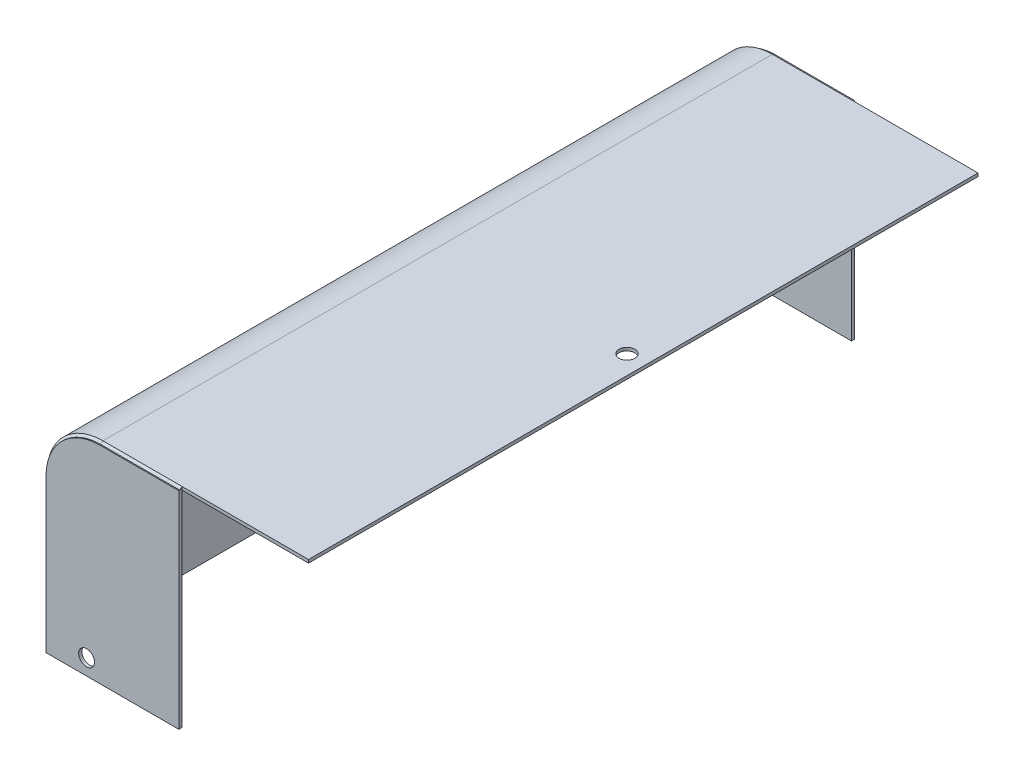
ISO-10303-21;
HEADER;
FILE_DESCRIPTION(('STEP AP214'),'2;1');
FILE_NAME('part.step','',(''),(''),'','','');
FILE_SCHEMA(('AUTOMOTIVE_DESIGN { 1 0 10303 214 1 1 1 1 }'));
ENDSEC;
DATA;
#1=APPLICATION_CONTEXT('core data for automotive mechanical design processes');
#2=APPLICATION_PROTOCOL_DEFINITION('international standard','automotive_design',2000,#1);
#3=PRODUCT_CONTEXT('',#1,'mechanical');
#4=PRODUCT('Part','Part','',(#3));
#5=PRODUCT_RELATED_PRODUCT_CATEGORY('part','',(#4));
#6=PRODUCT_DEFINITION_FORMATION('','',#4);
#7=PRODUCT_DEFINITION_CONTEXT('part definition',#1,'design');
#8=PRODUCT_DEFINITION('design','',#6,#7);
#9=PRODUCT_DEFINITION_SHAPE('','',#8);
#10=(LENGTH_UNIT() NAMED_UNIT(*) SI_UNIT(.MILLI.,.METRE.));
#11=(NAMED_UNIT(*) PLANE_ANGLE_UNIT() SI_UNIT($,.RADIAN.));
#12=(NAMED_UNIT(*) SI_UNIT($,.STERADIAN.) SOLID_ANGLE_UNIT());
#13=UNCERTAINTY_MEASURE_WITH_UNIT(LENGTH_MEASURE(1.E-05),#10,'distance_accuracy_value','');
#14=(GEOMETRIC_REPRESENTATION_CONTEXT(3) GLOBAL_UNCERTAINTY_ASSIGNED_CONTEXT((#13)) GLOBAL_UNIT_ASSIGNED_CONTEXT((#10,
#11,#12)) REPRESENTATION_CONTEXT('',''));
#15=CARTESIAN_POINT('',(0.,0.,0.));
#16=DIRECTION('',(0.,0.,1.));
#17=DIRECTION('',(1.,0.,0.));
#18=AXIS2_PLACEMENT_3D('',#15,#16,#17);
#19=CARTESIAN_POINT('',(-32.3472856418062,-130.353881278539,635.));
#20=DIRECTION('',(0.,1.,0.));
#21=DIRECTION('',(0.,0.,1.));
#22=AXIS2_PLACEMENT_3D('',#19,#20,#21);
#23=PLANE('',#22);
#24=DIRECTION('',(1.,0.,0.));
#25=VECTOR('',#24,1.);
#26=CARTESIAN_POINT('',(20.6527143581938,-130.353881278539,635.));
#27=LINE('',#26,#25);
#28=CARTESIAN_POINT('',(-32.3472856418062,-130.353881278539,635.));
#29=VERTEX_POINT('',#28);
#30=CARTESIAN_POINT('',(-30.3472856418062,-130.353881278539,635.));
#31=VERTEX_POINT('',#30);
#32=EDGE_CURVE('E125',#29,#31,#27,.T.);
#33=ORIENTED_EDGE('',*,*,#32,.T.);
#34=DIRECTION('',(0.,0.,-1.));
#35=VECTOR('',#34,1.);
#36=CARTESIAN_POINT('',(-30.3472856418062,-130.353881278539,635.));
#37=LINE('',#36,#35);
#38=CARTESIAN_POINT('',(-30.3472856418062,-130.353881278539,637.));
#39=VERTEX_POINT('',#38);
#40=EDGE_CURVE('E64',#39,#31,#37,.T.);
#41=ORIENTED_EDGE('',*,*,#40,.F.);
#42=DIRECTION('',(0.707106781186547,0.,0.707106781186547));
#43=VECTOR('',#42,1.);
#44=CARTESIAN_POINT('',(-32.3472856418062,-130.353881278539,635.));
#45=LINE('',#44,#43);
#46=EDGE_CURVE('E12',#39,#29,#45,.F.);
#47=ORIENTED_EDGE('',*,*,#46,.T.);
#48=EDGE_LOOP('',(#33,#41,#47));
#49=FACE_BOUND('',#48,.T.);
#50=ADVANCED_FACE('F42',(#49),#23,.F.);
#51=CARTESIAN_POINT('',(95.6527143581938,-130.353881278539,638.));
#52=DIRECTION('',(-1.,0.,0.));
#53=DIRECTION('',(0.,0.,1.));
#54=AXIS2_PLACEMENT_3D('',#51,#52,#53);
#55=PLANE('',#54);
#56=DIRECTION('',(0.,0.,-1.));
#57=VECTOR('',#56,1.);
#58=CARTESIAN_POINT('',(95.6527143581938,65.6461187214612,638.));
#59=LINE('',#58,#57);
#60=CARTESIAN_POINT('',(95.6527143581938,65.6461187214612,637.));
#61=VERTEX_POINT('',#60);
#62=CARTESIAN_POINT('',(95.6527143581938,65.6461187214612,635.));
#63=VERTEX_POINT('',#62);
#64=EDGE_CURVE('E57',#61,#63,#59,.T.);
#65=ORIENTED_EDGE('',*,*,#64,.T.);
#66=DIRECTION('',(0.,-1.,0.));
#67=VECTOR('',#66,1.);
#68=CARTESIAN_POINT('',(95.6527143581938,-130.353881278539,635.));
#69=LINE('',#68,#67);
#70=CARTESIAN_POINT('',(95.6527143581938,67.6461187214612,635.));
#71=VERTEX_POINT('',#70);
#72=EDGE_CURVE('E130',#71,#63,#69,.T.);
#73=ORIENTED_EDGE('',*,*,#72,.F.);
#74=DIRECTION('',(0.,0.707106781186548,-0.707106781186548));
#75=VECTOR('',#74,1.);
#76=CARTESIAN_POINT('',(95.6527143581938,-32.8538812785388,735.5));
#77=LINE('',#76,#75);
#78=EDGE_CURVE('E50',#71,#61,#77,.F.);
#79=ORIENTED_EDGE('',*,*,#78,.T.);
#80=EDGE_LOOP('',(#65,#73,#79));
#81=FACE_BOUND('',#80,.T.);
#82=ADVANCED_FACE('F44',(#81),#55,.F.);
#83=CARTESIAN_POINT('',(-30.3472856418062,14.6461187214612,637.));
#84=DIRECTION('',(-0.707106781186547,0.,0.707106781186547));
#85=DIRECTION('',(0.707106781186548,0.,0.707106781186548));
#86=AXIS2_PLACEMENT_3D('',#83,#84,#85);
#87=PLANE('',#86);
#88=ORIENTED_EDGE('',*,*,#46,.F.);
#89=DIRECTION('',(0.,-1.,0.));
#90=VECTOR('',#89,1.);
#91=CARTESIAN_POINT('',(-30.3472856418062,-130.353881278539,637.));
#92=LINE('',#91,#90);
#93=CARTESIAN_POINT('',(-30.3472856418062,14.6461187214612,637.));
#94=VERTEX_POINT('',#93);
#95=EDGE_CURVE('E144',#94,#39,#92,.T.);
#96=ORIENTED_EDGE('',*,*,#95,.F.);
#97=DIRECTION('',(0.707106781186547,0.,0.707106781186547));
#98=VECTOR('',#97,1.);
#99=CARTESIAN_POINT('',(-32.3472856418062,14.6461187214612,635.));
#100=LINE('',#99,#98);
#101=CARTESIAN_POINT('',(-32.3472856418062,14.6461187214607,635.));
#102=VERTEX_POINT('',#101);
#103=EDGE_CURVE('E135',#102,#94,#100,.T.);
#104=ORIENTED_EDGE('',*,*,#103,.F.);
#105=DIRECTION('',(0.,-1.,0.));
#106=VECTOR('',#105,1.);
#107=CARTESIAN_POINT('',(-32.3472856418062,14.6461187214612,635.));
#108=LINE('',#107,#106);
#109=EDGE_CURVE('E116',#102,#29,#108,.T.);
#110=ORIENTED_EDGE('',*,*,#109,.T.);
#111=EDGE_LOOP('',(#88,#96,#104,#110));
#112=FACE_BOUND('',#111,.T.);
#113=ADVANCED_FACE('F166',(#112),#87,.T.);
#114=CARTESIAN_POINT('',(20.6527143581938,14.6461187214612,637.));
#115=DIRECTION('',(0.,0.,-1.));
#116=DIRECTION('',(-1.,0.,0.));
#117=AXIS2_PLACEMENT_3D('',#114,#115,#116);
#118=CONICAL_SURFACE('',#117,51.,0.785398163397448);
#119=ORIENTED_EDGE('',*,*,#103,.T.);
#120=CARTESIAN_POINT('',(20.6527143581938,14.6461187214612,637.));
#121=DIRECTION('',(0.,0.,-1.));
#122=DIRECTION('',(-1.,0.,0.));
#123=AXIS2_PLACEMENT_3D('',#120,#121,#122);
#124=CIRCLE('',#123,51.);
#125=CARTESIAN_POINT('',(20.6527143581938,65.6461187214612,637.));
#126=VERTEX_POINT('',#125);
#127=EDGE_CURVE('E104',#126,#94,#124,.F.);
#128=ORIENTED_EDGE('',*,*,#127,.F.);
#129=DIRECTION('',(0.,-0.707106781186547,0.707106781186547));
#130=VECTOR('',#129,1.);
#131=CARTESIAN_POINT('',(20.6527143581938,67.6461187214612,635.));
#132=LINE('',#131,#130);
#133=CARTESIAN_POINT('',(20.6527143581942,67.6461187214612,635.));
#134=VERTEX_POINT('',#133);
#135=EDGE_CURVE('E132',#134,#126,#132,.T.);
#136=ORIENTED_EDGE('',*,*,#135,.F.);
#137=CARTESIAN_POINT('',(20.6527143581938,14.6461187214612,635.));
#138=DIRECTION('',(0.,0.,-1.));
#139=DIRECTION('',(-1.,0.,0.));
#140=AXIS2_PLACEMENT_3D('',#137,#138,#139);
#141=CIRCLE('',#140,53.);
#142=EDGE_CURVE('E120',#134,#102,#141,.F.);
#143=ORIENTED_EDGE('',*,*,#142,.T.);
#144=EDGE_LOOP('',(#119,#128,#136,#143));
#145=FACE_BOUND('',#144,.T.);
#146=ADVANCED_FACE('F170',(#145),#118,.T.);
#147=CARTESIAN_POINT('',(95.6527143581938,65.6461187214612,637.));
#148=DIRECTION('',(0.,0.707106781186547,0.707106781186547));
#149=DIRECTION('',(0.,-0.707106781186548,0.707106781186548));
#150=AXIS2_PLACEMENT_3D('',#147,#148,#149);
#151=PLANE('',#150);
#152=ORIENTED_EDGE('',*,*,#78,.F.);
#153=DIRECTION('',(-1.,0.,0.));
#154=VECTOR('',#153,1.);
#155=CARTESIAN_POINT('',(20.6527143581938,67.6461187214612,635.));
#156=LINE('',#155,#154);
#157=EDGE_CURVE('E138',#71,#134,#156,.T.);
#158=ORIENTED_EDGE('',*,*,#157,.T.);
#159=ORIENTED_EDGE('',*,*,#135,.T.);
#160=DIRECTION('',(-1.,0.,0.));
#161=VECTOR('',#160,1.);
#162=CARTESIAN_POINT('',(20.6527143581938,65.6461187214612,637.));
#163=LINE('',#162,#161);
#164=EDGE_CURVE('E141',#61,#126,#163,.T.);
#165=ORIENTED_EDGE('',*,*,#164,.F.);
#166=EDGE_LOOP('',(#152,#158,#159,#165));
#167=FACE_BOUND('',#166,.T.);
#168=ADVANCED_FACE('F150',(#167),#151,.T.);
#169=CARTESIAN_POINT('',(-30.3472856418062,14.6461187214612,638.));
#170=DIRECTION('',(1.,0.,0.));
#171=DIRECTION('',(0.,1.,0.));
#172=AXIS2_PLACEMENT_3D('',#169,#170,#171);
#173=PLANE('',#172);
#174=ORIENTED_EDGE('',*,*,#95,.T.);
#175=ORIENTED_EDGE('',*,*,#40,.T.);
#176=DIRECTION('',(0.,-1.,0.));
#177=VECTOR('',#176,1.);
#178=CARTESIAN_POINT('',(-30.3472856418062,14.6461187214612,635.));
#179=LINE('',#178,#177);
#180=CARTESIAN_POINT('',(-30.3472856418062,14.6461187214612,635.));
#181=VERTEX_POINT('',#180);
#182=EDGE_CURVE('E110',#181,#31,#179,.T.);
#183=ORIENTED_EDGE('',*,*,#182,.F.);
#184=DIRECTION('',(0.,0.,1.));
#185=VECTOR('',#184,1.);
#186=CARTESIAN_POINT('',(-30.3472856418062,14.6461187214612,638.));
#187=LINE('',#186,#185);
#188=EDGE_CURVE('E96',#94,#181,#187,.F.);
#189=ORIENTED_EDGE('',*,*,#188,.F.);
#190=EDGE_LOOP('',(#174,#175,#183,#189));
#191=FACE_BOUND('',#190,.T.);
#192=ADVANCED_FACE('F111',(#191),#173,.T.);
#193=CARTESIAN_POINT('',(20.6527143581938,14.6461187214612,635.));
#194=DIRECTION('',(0.,0.,-1.));
#195=DIRECTION('',(-1.,0.,0.));
#196=AXIS2_PLACEMENT_3D('',#193,#194,#195);
#197=PLANE('',#196);
#198=ORIENTED_EDGE('',*,*,#72,.T.);
#199=DIRECTION('',(-1.,0.,0.));
#200=VECTOR('',#199,1.);
#201=CARTESIAN_POINT('',(20.6527143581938,65.6461187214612,635.));
#202=LINE('',#201,#200);
#203=CARTESIAN_POINT('',(20.6527143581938,65.6461187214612,635.));
#204=VERTEX_POINT('',#203);
#205=EDGE_CURVE('E113',#63,#204,#202,.T.);
#206=ORIENTED_EDGE('',*,*,#205,.T.);
#207=CARTESIAN_POINT('',(20.6527143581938,14.6461187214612,635.));
#208=DIRECTION('',(0.,0.,-1.));
#209=DIRECTION('',(-1.,0.,0.));
#210=AXIS2_PLACEMENT_3D('',#207,#208,#209);
#211=CIRCLE('',#210,51.);
#212=EDGE_CURVE('E101',#204,#181,#211,.F.);
#213=ORIENTED_EDGE('',*,*,#212,.T.);
#214=ORIENTED_EDGE('',*,*,#182,.T.);
#215=ORIENTED_EDGE('',*,*,#32,.F.);
#216=ORIENTED_EDGE('',*,*,#109,.F.);
#217=ORIENTED_EDGE('',*,*,#142,.F.);
#218=ORIENTED_EDGE('',*,*,#157,.F.);
#219=EDGE_LOOP('',(#198,#206,#213,#214,#215,#216,#217,#218));
#220=FACE_BOUND('',#219,.T.);
#221=ADVANCED_FACE('F115',(#220),#197,.T.);
#222=CARTESIAN_POINT('',(95.6527143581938,65.6461187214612,638.));
#223=DIRECTION('',(0.,-1.,0.));
#224=DIRECTION('',(0.,0.,-1.));
#225=AXIS2_PLACEMENT_3D('',#222,#223,#224);
#226=PLANE('',#225);
#227=ORIENTED_EDGE('',*,*,#164,.T.);
#228=DIRECTION('',(0.,0.,-1.));
#229=VECTOR('',#228,1.);
#230=CARTESIAN_POINT('',(20.6527143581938,65.6461187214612,638.));
#231=LINE('',#230,#229);
#232=EDGE_CURVE('E107',#126,#204,#231,.T.);
#233=ORIENTED_EDGE('',*,*,#232,.T.);
#234=ORIENTED_EDGE('',*,*,#205,.F.);
#235=ORIENTED_EDGE('',*,*,#64,.F.);
#236=EDGE_LOOP('',(#227,#233,#234,#235));
#237=FACE_BOUND('',#236,.T.);
#238=ADVANCED_FACE('F152',(#237),#226,.T.);
#239=CARTESIAN_POINT('',(20.6527143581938,14.6461187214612,638.));
#240=DIRECTION('',(0.,0.,-1.));
#241=DIRECTION('',(-1.,0.,0.));
#242=AXIS2_PLACEMENT_3D('',#239,#240,#241);
#243=CYLINDRICAL_SURFACE('',#242,51.);
#244=ORIENTED_EDGE('',*,*,#127,.T.);
#245=ORIENTED_EDGE('',*,*,#188,.T.);
#246=ORIENTED_EDGE('',*,*,#212,.F.);
#247=ORIENTED_EDGE('',*,*,#232,.F.);
#248=EDGE_LOOP('',(#244,#245,#246,#247));
#249=FACE_BOUND('',#248,.T.);
#250=ADVANCED_FACE('F98',(#249),#243,.F.);
#251=CLOSED_SHELL('',(#50,#82,#113,#146,#168,#192,#221,#238,#250));
#252=MANIFOLD_SOLID_BREP('B2',#251);
#253=CARTESIAN_POINT('',(95.6527143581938,-130.353881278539,-3.));
#254=DIRECTION('',(-1.,0.,0.));
#255=DIRECTION('',(0.,0.,1.));
#256=AXIS2_PLACEMENT_3D('',#253,#254,#255);
#257=PLANE('',#256);
#258=DIRECTION('',(0.,0.,1.));
#259=VECTOR('',#258,1.);
#260=CARTESIAN_POINT('',(95.6527143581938,65.6461187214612,-3.));
#261=LINE('',#260,#259);
#262=CARTESIAN_POINT('',(95.6527143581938,65.6461187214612,-2.));
#263=VERTEX_POINT('',#262);
#264=CARTESIAN_POINT('',(95.6527143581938,65.6461187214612,0.));
#265=VERTEX_POINT('',#264);
#266=EDGE_CURVE('E294',#263,#265,#261,.T.);
#267=ORIENTED_EDGE('',*,*,#266,.F.);
#268=DIRECTION('',(0.,0.707106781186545,0.70710678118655));
#269=VECTOR('',#268,1.);
#270=CARTESIAN_POINT('',(95.6527143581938,-32.8538812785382,-100.5));
#271=LINE('',#270,#269);
#272=CARTESIAN_POINT('',(95.6527143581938,67.6461187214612,0.));
#273=VERTEX_POINT('',#272);
#274=EDGE_CURVE('E40',#263,#273,#271,.T.);
#275=ORIENTED_EDGE('',*,*,#274,.T.);
#276=DIRECTION('',(0.,-1.,0.));
#277=VECTOR('',#276,1.);
#278=CARTESIAN_POINT('',(95.6527143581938,-130.353881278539,0.));
#279=LINE('',#278,#277);
#280=EDGE_CURVE('E306',#273,#265,#279,.T.);
#281=ORIENTED_EDGE('',*,*,#280,.T.);
#282=EDGE_LOOP('',(#267,#275,#281));
#283=FACE_BOUND('',#282,.T.);
#284=ADVANCED_FACE('F242',(#283),#257,.F.);
#285=CARTESIAN_POINT('',(-32.3472856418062,-130.353881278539,635.));
#286=DIRECTION('',(0.,1.,0.));
#287=DIRECTION('',(0.,0.,1.));
#288=AXIS2_PLACEMENT_3D('',#285,#286,#287);
#289=PLANE('',#288);
#290=DIRECTION('',(0.,0.,1.));
#291=VECTOR('',#290,1.);
#292=CARTESIAN_POINT('',(-30.3472856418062,-130.353881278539,-3.));
#293=LINE('',#292,#291);
#294=CARTESIAN_POINT('',(-30.3472856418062,-130.353881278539,-2.));
#295=VERTEX_POINT('',#294);
#296=CARTESIAN_POINT('',(-30.3472856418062,-130.353881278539,0.));
#297=VERTEX_POINT('',#296);
#298=EDGE_CURVE('E256',#295,#297,#293,.T.);
#299=ORIENTED_EDGE('',*,*,#298,.T.);
#300=DIRECTION('',(1.,0.,0.));
#301=VECTOR('',#300,1.);
#302=CARTESIAN_POINT('',(20.6527143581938,-130.353881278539,0.));
#303=LINE('',#302,#301);
#304=CARTESIAN_POINT('',(-32.3472856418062,-130.353881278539,0.));
#305=VERTEX_POINT('',#304);
#306=EDGE_CURVE('E336',#305,#297,#303,.T.);
#307=ORIENTED_EDGE('',*,*,#306,.F.);
#308=DIRECTION('',(0.707106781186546,0.,-0.707106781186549));
#309=VECTOR('',#308,1.);
#310=CARTESIAN_POINT('',(-349.847285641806,-130.353881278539,317.500000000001));
#311=LINE('',#310,#309);
#312=EDGE_CURVE('E249',#305,#295,#311,.T.);
#313=ORIENTED_EDGE('',*,*,#312,.T.);
#314=EDGE_LOOP('',(#299,#307,#313));
#315=FACE_BOUND('',#314,.T.);
#316=ADVANCED_FACE('F335',(#315),#289,.F.);
#317=CARTESIAN_POINT('',(20.6527143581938,67.6461187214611,0.));
#318=DIRECTION('',(0.,-0.70710678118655,0.707106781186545));
#319=DIRECTION('',(0.,-0.707106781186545,-0.70710678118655));
#320=AXIS2_PLACEMENT_3D('',#317,#318,#319);
#321=PLANE('',#320);
#322=ORIENTED_EDGE('',*,*,#274,.F.);
#323=DIRECTION('',(1.,0.,0.));
#324=VECTOR('',#323,1.);
#325=CARTESIAN_POINT('',(95.6527143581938,65.6461187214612,-2.));
#326=LINE('',#325,#324);
#327=CARTESIAN_POINT('',(20.6527143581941,65.6461187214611,-2.));
#328=VERTEX_POINT('',#327);
#329=EDGE_CURVE('E264',#328,#263,#326,.T.);
#330=ORIENTED_EDGE('',*,*,#329,.F.);
#331=DIRECTION('',(0.,-0.707106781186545,-0.70710678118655));
#332=VECTOR('',#331,1.);
#333=CARTESIAN_POINT('',(20.6527143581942,67.6461187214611,0.));
#334=LINE('',#333,#332);
#335=CARTESIAN_POINT('',(20.6527143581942,67.6461187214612,0.));
#336=VERTEX_POINT('',#335);
#337=EDGE_CURVE('E317',#336,#328,#334,.T.);
#338=ORIENTED_EDGE('',*,*,#337,.F.);
#339=DIRECTION('',(-1.,0.,0.));
#340=VECTOR('',#339,1.);
#341=CARTESIAN_POINT('',(20.6527143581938,67.6461187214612,0.));
#342=LINE('',#341,#340);
#343=EDGE_CURVE('E325',#273,#336,#342,.T.);
#344=ORIENTED_EDGE('',*,*,#343,.F.);
#345=EDGE_LOOP('',(#322,#330,#338,#344));
#346=FACE_BOUND('',#345,.T.);
#347=ADVANCED_FACE('F353',(#346),#321,.F.);
#348=CARTESIAN_POINT('',(20.6527143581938,14.6461187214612,0.));
#349=DIRECTION('',(0.,0.,1.));
#350=DIRECTION('',(1.,0.,0.));
#351=AXIS2_PLACEMENT_3D('',#348,#349,#350);
#352=CONICAL_SURFACE('',#351,53.,0.785398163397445);
#353=ORIENTED_EDGE('',*,*,#337,.T.);
#354=CARTESIAN_POINT('',(20.6527143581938,14.6461187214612,-2.));
#355=DIRECTION('',(0.,0.,-1.));
#356=DIRECTION('',(-1.,0.,0.));
#357=AXIS2_PLACEMENT_3D('',#354,#355,#356);
#358=CIRCLE('',#357,51.);
#359=CARTESIAN_POINT('',(-30.3472856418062,14.6461187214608,-2.));
#360=VERTEX_POINT('',#359);
#361=EDGE_CURVE('E329',#360,#328,#358,.T.);
#362=ORIENTED_EDGE('',*,*,#361,.F.);
#363=DIRECTION('',(0.707106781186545,0.,-0.70710678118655));
#364=VECTOR('',#363,1.);
#365=CARTESIAN_POINT('',(-32.3472856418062,14.6461187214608,0.));
#366=LINE('',#365,#364);
#367=CARTESIAN_POINT('',(-32.3472856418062,14.6461187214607,0.));
#368=VERTEX_POINT('',#367);
#369=EDGE_CURVE('E313',#368,#360,#366,.T.);
#370=ORIENTED_EDGE('',*,*,#369,.F.);
#371=CARTESIAN_POINT('',(20.6527143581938,14.6461187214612,0.));
#372=DIRECTION('',(0.,0.,-1.));
#373=DIRECTION('',(-1.,0.,0.));
#374=AXIS2_PLACEMENT_3D('',#371,#372,#373);
#375=CIRCLE('',#374,53.);
#376=EDGE_CURVE('E351',#336,#368,#375,.F.);
#377=ORIENTED_EDGE('',*,*,#376,.F.);
#378=EDGE_LOOP('',(#353,#362,#370,#377));
#379=FACE_BOUND('',#378,.T.);
#380=ADVANCED_FACE('F348',(#379),#352,.T.);
#381=CARTESIAN_POINT('',(-32.3472856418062,14.6461187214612,0.));
#382=DIRECTION('',(0.707106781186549,0.,0.707106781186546));
#383=DIRECTION('',(0.707106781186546,0.,-0.707106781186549));
#384=AXIS2_PLACEMENT_3D('',#381,#382,#383);
#385=PLANE('',#384);
#386=ORIENTED_EDGE('',*,*,#369,.T.);
#387=DIRECTION('',(0.,1.,0.));
#388=VECTOR('',#387,1.);
#389=CARTESIAN_POINT('',(-30.3472856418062,-130.353881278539,-2.));
#390=LINE('',#389,#388);
#391=EDGE_CURVE('E327',#295,#360,#390,.T.);
#392=ORIENTED_EDGE('',*,*,#391,.F.);
#393=ORIENTED_EDGE('',*,*,#312,.F.);
#394=DIRECTION('',(0.,-1.,0.));
#395=VECTOR('',#394,1.);
#396=CARTESIAN_POINT('',(-32.3472856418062,14.6461187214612,0.));
#397=LINE('',#396,#395);
#398=EDGE_CURVE('E310',#368,#305,#397,.T.);
#399=ORIENTED_EDGE('',*,*,#398,.F.);
#400=EDGE_LOOP('',(#386,#392,#393,#399));
#401=FACE_BOUND('',#400,.T.);
#402=ADVANCED_FACE('F339',(#401),#385,.F.);
#403=CARTESIAN_POINT('',(95.6527143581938,65.6461187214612,-3.));
#404=DIRECTION('',(0.,-1.,0.));
#405=DIRECTION('',(1.,0.,0.));
#406=AXIS2_PLACEMENT_3D('',#403,#404,#405);
#407=PLANE('',#406);
#408=ORIENTED_EDGE('',*,*,#329,.T.);
#409=ORIENTED_EDGE('',*,*,#266,.T.);
#410=DIRECTION('',(-1.,0.,0.));
#411=VECTOR('',#410,1.);
#412=CARTESIAN_POINT('',(20.6527143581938,65.6461187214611,0.));
#413=LINE('',#412,#411);
#414=CARTESIAN_POINT('',(20.6527143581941,65.6461187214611,0.));
#415=VERTEX_POINT('',#414);
#416=EDGE_CURVE('E297',#265,#415,#413,.T.);
#417=ORIENTED_EDGE('',*,*,#416,.T.);
#418=DIRECTION('',(0.,0.,1.));
#419=VECTOR('',#418,1.);
#420=CARTESIAN_POINT('',(20.6527143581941,65.6461187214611,-3.));
#421=LINE('',#420,#419);
#422=EDGE_CURVE('E301',#328,#415,#421,.T.);
#423=ORIENTED_EDGE('',*,*,#422,.F.);
#424=EDGE_LOOP('',(#408,#409,#417,#423));
#425=FACE_BOUND('',#424,.T.);
#426=ADVANCED_FACE('F296',(#425),#407,.T.);
#427=CARTESIAN_POINT('',(20.6527143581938,14.6461187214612,0.));
#428=DIRECTION('',(0.,0.,-1.));
#429=DIRECTION('',(-1.,0.,0.));
#430=AXIS2_PLACEMENT_3D('',#427,#428,#429);
#431=PLANE('',#430);
#432=ORIENTED_EDGE('',*,*,#343,.T.);
#433=ORIENTED_EDGE('',*,*,#376,.T.);
#434=ORIENTED_EDGE('',*,*,#398,.T.);
#435=ORIENTED_EDGE('',*,*,#306,.T.);
#436=DIRECTION('',(0.,-1.,0.));
#437=VECTOR('',#436,1.);
#438=CARTESIAN_POINT('',(-30.3472856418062,14.6461187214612,0.));
#439=LINE('',#438,#437);
#440=CARTESIAN_POINT('',(-30.3472856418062,14.6461187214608,0.));
#441=VERTEX_POINT('',#440);
#442=EDGE_CURVE('E314',#441,#297,#439,.T.);
#443=ORIENTED_EDGE('',*,*,#442,.F.);
#444=CARTESIAN_POINT('',(20.6527143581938,14.6461187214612,0.));
#445=DIRECTION('',(0.,0.,-1.));
#446=DIRECTION('',(-1.,0.,0.));
#447=AXIS2_PLACEMENT_3D('',#444,#445,#446);
#448=CIRCLE('',#447,51.);
#449=EDGE_CURVE('E309',#415,#441,#448,.F.);
#450=ORIENTED_EDGE('',*,*,#449,.F.);
#451=ORIENTED_EDGE('',*,*,#416,.F.);
#452=ORIENTED_EDGE('',*,*,#280,.F.);
#453=EDGE_LOOP('',(#432,#433,#434,#435,#443,#450,#451,#452));
#454=FACE_BOUND('',#453,.T.);
#455=ADVANCED_FACE('F305',(#454),#431,.F.);
#456=CARTESIAN_POINT('',(-30.3472856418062,-130.353881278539,-3.));
#457=DIRECTION('',(1.,0.,0.));
#458=DIRECTION('',(0.,0.,-1.));
#459=AXIS2_PLACEMENT_3D('',#456,#457,#458);
#460=PLANE('',#459);
#461=ORIENTED_EDGE('',*,*,#391,.T.);
#462=DIRECTION('',(0.,0.,1.));
#463=VECTOR('',#462,1.);
#464=CARTESIAN_POINT('',(-30.3472856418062,14.6461187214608,-3.));
#465=LINE('',#464,#463);
#466=EDGE_CURVE('E343',#360,#441,#465,.T.);
#467=ORIENTED_EDGE('',*,*,#466,.T.);
#468=ORIENTED_EDGE('',*,*,#442,.T.);
#469=ORIENTED_EDGE('',*,*,#298,.F.);
#470=EDGE_LOOP('',(#461,#467,#468,#469));
#471=FACE_BOUND('',#470,.T.);
#472=ADVANCED_FACE('F342',(#471),#460,.T.);
#473=CARTESIAN_POINT('',(20.6527143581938,14.6461187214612,-3.));
#474=DIRECTION('',(0.,0.,1.));
#475=DIRECTION('',(1.,0.,0.));
#476=AXIS2_PLACEMENT_3D('',#473,#474,#475);
#477=CYLINDRICAL_SURFACE('',#476,51.);
#478=ORIENTED_EDGE('',*,*,#361,.T.);
#479=ORIENTED_EDGE('',*,*,#422,.T.);
#480=ORIENTED_EDGE('',*,*,#449,.T.);
#481=ORIENTED_EDGE('',*,*,#466,.F.);
#482=EDGE_LOOP('',(#478,#479,#480,#481));
#483=FACE_BOUND('',#482,.T.);
#484=ADVANCED_FACE('F346',(#483),#477,.F.);
#485=CLOSED_SHELL('',(#284,#316,#347,#380,#402,#426,#455,#472,#484));
#486=MANIFOLD_SOLID_BREP('B6',#485);
#487=CARTESIAN_POINT('',(95.6527143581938,-130.353881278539,-3.));
#488=DIRECTION('',(-1.,0.,0.));
#489=DIRECTION('',(0.,0.,1.));
#490=AXIS2_PLACEMENT_3D('',#487,#488,#489);
#491=PLANE('',#490);
#492=DIRECTION('',(0.,-1.,0.));
#493=VECTOR('',#492,1.);
#494=CARTESIAN_POINT('',(95.6527143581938,-130.353881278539,0.));
#495=LINE('',#494,#493);
#496=CARTESIAN_POINT('',(95.6527143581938,65.6461187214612,0.));
#497=VERTEX_POINT('',#496);
#498=CARTESIAN_POINT('',(95.6527143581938,-130.353881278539,0.));
#499=VERTEX_POINT('',#498);
#500=EDGE_CURVE('E493',#497,#499,#495,.T.);
#501=ORIENTED_EDGE('',*,*,#500,.T.);
#502=DIRECTION('',(0.,0.,1.));
#503=VECTOR('',#502,1.);
#504=CARTESIAN_POINT('',(95.6527143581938,-130.353881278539,-3.));
#505=LINE('',#504,#503);
#506=CARTESIAN_POINT('',(95.6527143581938,-130.353881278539,-3.));
#507=VERTEX_POINT('',#506);
#508=EDGE_CURVE('E240',#507,#499,#505,.T.);
#509=ORIENTED_EDGE('',*,*,#508,.F.);
#510=DIRECTION('',(0.,-1.,0.));
#511=VECTOR('',#510,1.);
#512=CARTESIAN_POINT('',(95.6527143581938,-130.353881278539,-3.));
#513=LINE('',#512,#511);
#514=CARTESIAN_POINT('',(95.6527143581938,65.6461187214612,-3.));
#515=VERTEX_POINT('',#514);
#516=EDGE_CURVE('E517',#515,#507,#513,.T.);
#517=ORIENTED_EDGE('',*,*,#516,.F.);
#518=DIRECTION('',(0.,0.,1.));
#519=VECTOR('',#518,1.);
#520=CARTESIAN_POINT('',(95.6527143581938,65.6461187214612,-3.));
#521=LINE('',#520,#519);
#522=EDGE_CURVE('E506',#515,#497,#521,.T.);
#523=ORIENTED_EDGE('',*,*,#522,.T.);
#524=EDGE_LOOP('',(#501,#509,#517,#523));
#525=FACE_BOUND('',#524,.T.);
#526=ADVANCED_FACE('F442',(#525),#491,.F.);
#527=CARTESIAN_POINT('',(95.6527143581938,-130.353881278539,-3.));
#528=DIRECTION('',(0.,1.,0.));
#529=DIRECTION('',(-1.,0.,0.));
#530=AXIS2_PLACEMENT_3D('',#527,#528,#529);
#531=PLANE('',#530);
#532=DIRECTION('',(-1.,0.,0.));
#533=VECTOR('',#532,1.);
#534=CARTESIAN_POINT('',(95.6527143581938,-130.353881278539,0.));
#535=LINE('',#534,#533);
#536=CARTESIAN_POINT('',(-30.3472856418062,-130.353881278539,0.));
#537=VERTEX_POINT('',#536);
#538=EDGE_CURVE('E489',#499,#537,#535,.T.);
#539=ORIENTED_EDGE('',*,*,#538,.T.);
#540=DIRECTION('',(0.,0.,1.));
#541=VECTOR('',#540,1.);
#542=CARTESIAN_POINT('',(-30.3472856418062,-130.353881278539,-3.));
#543=LINE('',#542,#541);
#544=CARTESIAN_POINT('',(-30.3472856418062,-130.353881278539,-3.));
#545=VERTEX_POINT('',#544);
#546=EDGE_CURVE('E450',#545,#537,#543,.T.);
#547=ORIENTED_EDGE('',*,*,#546,.F.);
#548=DIRECTION('',(-1.,0.,0.));
#549=VECTOR('',#548,1.);
#550=CARTESIAN_POINT('',(95.6527143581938,-130.353881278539,-3.));
#551=LINE('',#550,#549);
#552=EDGE_CURVE('E502',#507,#545,#551,.T.);
#553=ORIENTED_EDGE('',*,*,#552,.F.);
#554=ORIENTED_EDGE('',*,*,#508,.T.);
#555=EDGE_LOOP('',(#539,#547,#553,#554));
#556=FACE_BOUND('',#555,.T.);
#557=ADVANCED_FACE('F501',(#556),#531,.F.);
#558=CARTESIAN_POINT('',(-30.3472856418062,-130.353881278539,-3.));
#559=DIRECTION('',(1.,0.,0.));
#560=DIRECTION('',(0.,0.,-1.));
#561=AXIS2_PLACEMENT_3D('',#558,#559,#560);
#562=PLANE('',#561);
#563=DIRECTION('',(0.,1.,0.));
#564=VECTOR('',#563,1.);
#565=CARTESIAN_POINT('',(-30.3472856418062,-130.353881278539,0.));
#566=LINE('',#565,#564);
#567=CARTESIAN_POINT('',(-30.3472856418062,14.6461187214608,0.));
#568=VERTEX_POINT('',#567);
#569=EDGE_CURVE('E495',#537,#568,#566,.T.);
#570=ORIENTED_EDGE('',*,*,#569,.T.);
#571=DIRECTION('',(0.,0.,1.));
#572=VECTOR('',#571,1.);
#573=CARTESIAN_POINT('',(-30.3472856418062,14.6461187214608,-3.));
#574=LINE('',#573,#572);
#575=CARTESIAN_POINT('',(-30.3472856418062,14.6461187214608,-3.));
#576=VERTEX_POINT('',#575);
#577=EDGE_CURVE('E528',#576,#568,#574,.T.);
#578=ORIENTED_EDGE('',*,*,#577,.F.);
#579=DIRECTION('',(0.,1.,0.));
#580=VECTOR('',#579,1.);
#581=CARTESIAN_POINT('',(-30.3472856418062,-130.353881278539,-3.));
#582=LINE('',#581,#580);
#583=EDGE_CURVE('E520',#545,#576,#582,.T.);
#584=ORIENTED_EDGE('',*,*,#583,.F.);
#585=ORIENTED_EDGE('',*,*,#546,.T.);
#586=EDGE_LOOP('',(#570,#578,#584,#585));
#587=FACE_BOUND('',#586,.T.);
#588=ADVANCED_FACE('F533',(#587),#562,.F.);
#589=CARTESIAN_POINT('',(20.6527143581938,14.6461187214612,-3.));
#590=DIRECTION('',(0.,0.,1.));
#591=DIRECTION('',(1.,0.,0.));
#592=AXIS2_PLACEMENT_3D('',#589,#590,#591);
#593=CYLINDRICAL_SURFACE('',#592,51.);
#594=CARTESIAN_POINT('',(20.6527143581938,14.6461187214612,0.));
#595=DIRECTION('',(0.,0.,-1.));
#596=DIRECTION('',(1.,0.,0.));
#597=AXIS2_PLACEMENT_3D('',#594,#595,#596);
#598=CIRCLE('',#597,51.);
#599=CARTESIAN_POINT('',(20.6527143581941,65.6461187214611,0.));
#600=VERTEX_POINT('',#599);
#601=EDGE_CURVE('E513',#568,#600,#598,.T.);
#602=ORIENTED_EDGE('',*,*,#601,.T.);
#603=DIRECTION('',(0.,0.,1.));
#604=VECTOR('',#603,1.);
#605=CARTESIAN_POINT('',(20.6527143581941,65.6461187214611,-3.));
#606=LINE('',#605,#604);
#607=CARTESIAN_POINT('',(20.6527143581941,65.6461187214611,-3.));
#608=VERTEX_POINT('',#607);
#609=EDGE_CURVE('E525',#608,#600,#606,.T.);
#610=ORIENTED_EDGE('',*,*,#609,.F.);
#611=CARTESIAN_POINT('',(20.6527143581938,14.6461187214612,-3.));
#612=DIRECTION('',(0.,0.,-1.));
#613=DIRECTION('',(1.,0.,0.));
#614=AXIS2_PLACEMENT_3D('',#611,#612,#613);
#615=CIRCLE('',#614,51.);
#616=EDGE_CURVE('E462',#576,#608,#615,.T.);
#617=ORIENTED_EDGE('',*,*,#616,.F.);
#618=ORIENTED_EDGE('',*,*,#577,.T.);
#619=EDGE_LOOP('',(#602,#610,#617,#618));
#620=FACE_BOUND('',#619,.T.);
#621=ADVANCED_FACE('F547',(#620),#593,.T.);
#622=CARTESIAN_POINT('',(95.6527143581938,65.6461187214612,-3.));
#623=DIRECTION('',(0.,-1.,0.));
#624=DIRECTION('',(1.,0.,0.));
#625=AXIS2_PLACEMENT_3D('',#622,#623,#624);
#626=PLANE('',#625);
#627=DIRECTION('',(1.,0.,0.));
#628=VECTOR('',#627,1.);
#629=CARTESIAN_POINT('',(95.6527143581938,65.6461187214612,0.));
#630=LINE('',#629,#628);
#631=EDGE_CURVE('E515',#600,#497,#630,.T.);
#632=ORIENTED_EDGE('',*,*,#631,.T.);
#633=ORIENTED_EDGE('',*,*,#522,.F.);
#634=DIRECTION('',(1.,0.,0.));
#635=VECTOR('',#634,1.);
#636=CARTESIAN_POINT('',(95.6527143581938,65.6461187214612,-3.));
#637=LINE('',#636,#635);
#638=EDGE_CURVE('E457',#608,#515,#637,.T.);
#639=ORIENTED_EDGE('',*,*,#638,.F.);
#640=ORIENTED_EDGE('',*,*,#609,.T.);
#641=EDGE_LOOP('',(#632,#633,#639,#640));
#642=FACE_BOUND('',#641,.T.);
#643=ADVANCED_FACE('F537',(#642),#626,.F.);
#644=CARTESIAN_POINT('',(20.6527143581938,14.6461187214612,-3.));
#645=DIRECTION('',(0.,0.,1.));
#646=DIRECTION('',(1.,0.,0.));
#647=AXIS2_PLACEMENT_3D('',#644,#645,#646);
#648=PLANE('',#647);
#649=CARTESIAN_POINT('',(8.15271435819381,-115.353881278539,-3.));
#650=DIRECTION('',(0.,0.,1.));
#651=DIRECTION('',(1.,0.,0.));
#652=AXIS2_PLACEMENT_3D('',#649,#650,#651);
#653=CIRCLE('',#652,7.5);
#654=CARTESIAN_POINT('',(15.6527143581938,-115.353881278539,-3.));
#655=VERTEX_POINT('',#654);
#656=EDGE_CURVE('E509',#655,#655,#653,.T.);
#657=ORIENTED_EDGE('',*,*,#656,.T.);
#658=EDGE_LOOP('',(#657));
#659=FACE_BOUND('',#658,.T.);
#660=ORIENTED_EDGE('',*,*,#516,.T.);
#661=ORIENTED_EDGE('',*,*,#552,.T.);
#662=ORIENTED_EDGE('',*,*,#583,.T.);
#663=ORIENTED_EDGE('',*,*,#616,.T.);
#664=ORIENTED_EDGE('',*,*,#638,.T.);
#665=EDGE_LOOP('',(#660,#661,#662,#663,#664));
#666=FACE_BOUND('',#665,.T.);
#667=ADVANCED_FACE('F535',(#659,#666),#648,.F.);
#668=CARTESIAN_POINT('',(20.6527143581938,14.6461187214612,0.));
#669=DIRECTION('',(0.,0.,1.));
#670=DIRECTION('',(1.,0.,0.));
#671=AXIS2_PLACEMENT_3D('',#668,#669,#670);
#672=PLANE('',#671);
#673=CARTESIAN_POINT('',(8.15271435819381,-115.353881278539,0.));
#674=DIRECTION('',(0.,0.,1.));
#675=DIRECTION('',(1.,0.,0.));
#676=AXIS2_PLACEMENT_3D('',#673,#674,#675);
#677=CIRCLE('',#676,7.5);
#678=CARTESIAN_POINT('',(15.6527143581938,-115.353881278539,0.));
#679=VERTEX_POINT('',#678);
#680=EDGE_CURVE('E445',#679,#679,#677,.T.);
#681=ORIENTED_EDGE('',*,*,#680,.F.);
#682=EDGE_LOOP('',(#681));
#683=FACE_BOUND('',#682,.T.);
#684=ORIENTED_EDGE('',*,*,#500,.F.);
#685=ORIENTED_EDGE('',*,*,#631,.F.);
#686=ORIENTED_EDGE('',*,*,#601,.F.);
#687=ORIENTED_EDGE('',*,*,#569,.F.);
#688=ORIENTED_EDGE('',*,*,#538,.F.);
#689=EDGE_LOOP('',(#684,#685,#686,#687,#688));
#690=FACE_BOUND('',#689,.T.);
#691=ADVANCED_FACE('F490',(#683,#690),#672,.T.);
#692=CARTESIAN_POINT('',(8.15271435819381,-115.353881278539,-3.));
#693=DIRECTION('',(0.,0.,1.));
#694=DIRECTION('',(1.,0.,0.));
#695=AXIS2_PLACEMENT_3D('',#692,#693,#694);
#696=CYLINDRICAL_SURFACE('',#695,7.5);
#697=ORIENTED_EDGE('',*,*,#680,.T.);
#698=EDGE_LOOP('',(#697));
#699=FACE_BOUND('',#698,.T.);
#700=ORIENTED_EDGE('',*,*,#656,.F.);
#701=EDGE_LOOP('',(#700));
#702=FACE_BOUND('',#701,.T.);
#703=ADVANCED_FACE('F544',(#699,#702),#696,.F.);
#704=CLOSED_SHELL('',(#526,#557,#588,#621,#643,#667,#691,#703));
#705=MANIFOLD_SOLID_BREP('B34',#704);
#706=CARTESIAN_POINT('',(-30.3472856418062,14.6461187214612,638.));
#707=DIRECTION('',(1.,0.,0.));
#708=DIRECTION('',(0.,1.,0.));
#709=AXIS2_PLACEMENT_3D('',#706,#707,#708);
#710=PLANE('',#709);
#711=DIRECTION('',(0.,-1.,0.));
#712=VECTOR('',#711,1.);
#713=CARTESIAN_POINT('',(-30.3472856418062,14.6461187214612,635.));
#714=LINE('',#713,#712);
#715=CARTESIAN_POINT('',(-30.3472856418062,14.6461187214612,635.));
#716=VERTEX_POINT('',#715);
#717=CARTESIAN_POINT('',(-30.3472856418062,-130.353881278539,635.));
#718=VERTEX_POINT('',#717);
#719=EDGE_CURVE('E673',#716,#718,#714,.T.);
#720=ORIENTED_EDGE('',*,*,#719,.T.);
#721=DIRECTION('',(0.,0.,-1.));
#722=VECTOR('',#721,1.);
#723=CARTESIAN_POINT('',(-30.3472856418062,-130.353881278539,638.));
#724=LINE('',#723,#722);
#725=CARTESIAN_POINT('',(-30.3472856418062,-130.353881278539,638.));
#726=VERTEX_POINT('',#725);
#727=EDGE_CURVE('E440',#726,#718,#724,.T.);
#728=ORIENTED_EDGE('',*,*,#727,.F.);
#729=DIRECTION('',(0.,-1.,0.));
#730=VECTOR('',#729,1.);
#731=CARTESIAN_POINT('',(-30.3472856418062,14.6461187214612,638.));
#732=LINE('',#731,#730);
#733=CARTESIAN_POINT('',(-30.3472856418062,14.6461187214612,638.));
#734=VERTEX_POINT('',#733);
#735=EDGE_CURVE('E697',#734,#726,#732,.T.);
#736=ORIENTED_EDGE('',*,*,#735,.F.);
#737=DIRECTION('',(0.,0.,-1.));
#738=VECTOR('',#737,1.);
#739=CARTESIAN_POINT('',(-30.3472856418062,14.6461187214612,638.));
#740=LINE('',#739,#738);
#741=EDGE_CURVE('E686',#734,#716,#740,.T.);
#742=ORIENTED_EDGE('',*,*,#741,.T.);
#743=EDGE_LOOP('',(#720,#728,#736,#742));
#744=FACE_BOUND('',#743,.T.);
#745=ADVANCED_FACE('F622',(#744),#710,.F.);
#746=CARTESIAN_POINT('',(-30.3472856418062,-130.353881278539,638.));
#747=DIRECTION('',(0.,1.,0.));
#748=DIRECTION('',(0.,0.,1.));
#749=AXIS2_PLACEMENT_3D('',#746,#747,#748);
#750=PLANE('',#749);
#751=DIRECTION('',(1.,0.,0.));
#752=VECTOR('',#751,1.);
#753=CARTESIAN_POINT('',(-30.3472856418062,-130.353881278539,635.));
#754=LINE('',#753,#752);
#755=CARTESIAN_POINT('',(95.6527143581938,-130.353881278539,635.));
#756=VERTEX_POINT('',#755);
#757=EDGE_CURVE('E669',#718,#756,#754,.T.);
#758=ORIENTED_EDGE('',*,*,#757,.T.);
#759=DIRECTION('',(0.,0.,-1.));
#760=VECTOR('',#759,1.);
#761=CARTESIAN_POINT('',(95.6527143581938,-130.353881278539,638.));
#762=LINE('',#761,#760);
#763=CARTESIAN_POINT('',(95.6527143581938,-130.353881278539,638.));
#764=VERTEX_POINT('',#763);
#765=EDGE_CURVE('E630',#764,#756,#762,.T.);
#766=ORIENTED_EDGE('',*,*,#765,.F.);
#767=DIRECTION('',(1.,0.,0.));
#768=VECTOR('',#767,1.);
#769=CARTESIAN_POINT('',(-30.3472856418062,-130.353881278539,638.));
#770=LINE('',#769,#768);
#771=EDGE_CURVE('E682',#726,#764,#770,.T.);
#772=ORIENTED_EDGE('',*,*,#771,.F.);
#773=ORIENTED_EDGE('',*,*,#727,.T.);
#774=EDGE_LOOP('',(#758,#766,#772,#773));
#775=FACE_BOUND('',#774,.T.);
#776=ADVANCED_FACE('F681',(#775),#750,.F.);
#777=CARTESIAN_POINT('',(95.6527143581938,-130.353881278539,638.));
#778=DIRECTION('',(-1.,0.,0.));
#779=DIRECTION('',(0.,0.,1.));
#780=AXIS2_PLACEMENT_3D('',#777,#778,#779);
#781=PLANE('',#780);
#782=DIRECTION('',(0.,1.,0.));
#783=VECTOR('',#782,1.);
#784=CARTESIAN_POINT('',(95.6527143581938,-130.353881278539,635.));
#785=LINE('',#784,#783);
#786=CARTESIAN_POINT('',(95.6527143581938,65.6461187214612,635.));
#787=VERTEX_POINT('',#786);
#788=EDGE_CURVE('E675',#756,#787,#785,.T.);
#789=ORIENTED_EDGE('',*,*,#788,.T.);
#790=DIRECTION('',(0.,0.,-1.));
#791=VECTOR('',#790,1.);
#792=CARTESIAN_POINT('',(95.6527143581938,65.6461187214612,638.));
#793=LINE('',#792,#791);
#794=CARTESIAN_POINT('',(95.6527143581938,65.6461187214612,638.));
#795=VERTEX_POINT('',#794);
#796=EDGE_CURVE('E708',#795,#787,#793,.T.);
#797=ORIENTED_EDGE('',*,*,#796,.F.);
#798=DIRECTION('',(0.,1.,0.));
#799=VECTOR('',#798,1.);
#800=CARTESIAN_POINT('',(95.6527143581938,-130.353881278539,638.));
#801=LINE('',#800,#799);
#802=EDGE_CURVE('E700',#764,#795,#801,.T.);
#803=ORIENTED_EDGE('',*,*,#802,.F.);
#804=ORIENTED_EDGE('',*,*,#765,.T.);
#805=EDGE_LOOP('',(#789,#797,#803,#804));
#806=FACE_BOUND('',#805,.T.);
#807=ADVANCED_FACE('F713',(#806),#781,.F.);
#808=CARTESIAN_POINT('',(95.6527143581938,65.6461187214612,638.));
#809=DIRECTION('',(0.,-1.,0.));
#810=DIRECTION('',(0.,0.,-1.));
#811=AXIS2_PLACEMENT_3D('',#808,#809,#810);
#812=PLANE('',#811);
#813=DIRECTION('',(-1.,0.,0.));
#814=VECTOR('',#813,1.);
#815=CARTESIAN_POINT('',(95.6527143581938,65.6461187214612,635.));
#816=LINE('',#815,#814);
#817=CARTESIAN_POINT('',(20.6527143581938,65.6461187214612,635.));
#818=VERTEX_POINT('',#817);
#819=EDGE_CURVE('E693',#787,#818,#816,.T.);
#820=ORIENTED_EDGE('',*,*,#819,.T.);
#821=DIRECTION('',(0.,0.,-1.));
#822=VECTOR('',#821,1.);
#823=CARTESIAN_POINT('',(20.6527143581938,65.6461187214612,638.));
#824=LINE('',#823,#822);
#825=CARTESIAN_POINT('',(20.6527143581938,65.6461187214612,638.));
#826=VERTEX_POINT('',#825);
#827=EDGE_CURVE('E705',#826,#818,#824,.T.);
#828=ORIENTED_EDGE('',*,*,#827,.F.);
#829=DIRECTION('',(-1.,0.,0.));
#830=VECTOR('',#829,1.);
#831=CARTESIAN_POINT('',(95.6527143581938,65.6461187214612,638.));
#832=LINE('',#831,#830);
#833=EDGE_CURVE('E642',#795,#826,#832,.T.);
#834=ORIENTED_EDGE('',*,*,#833,.F.);
#835=ORIENTED_EDGE('',*,*,#796,.T.);
#836=EDGE_LOOP('',(#820,#828,#834,#835));
#837=FACE_BOUND('',#836,.T.);
#838=ADVANCED_FACE('F727',(#837),#812,.F.);
#839=CARTESIAN_POINT('',(20.6527143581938,14.6461187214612,638.));
#840=DIRECTION('',(0.,0.,-1.));
#841=DIRECTION('',(-1.,0.,0.));
#842=AXIS2_PLACEMENT_3D('',#839,#840,#841);
#843=CYLINDRICAL_SURFACE('',#842,51.);
#844=CARTESIAN_POINT('',(20.6527143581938,14.6461187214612,635.));
#845=DIRECTION('',(0.,0.,1.));
#846=DIRECTION('',(-1.,0.,0.));
#847=AXIS2_PLACEMENT_3D('',#844,#845,#846);
#848=CIRCLE('',#847,51.);
#849=EDGE_CURVE('E695',#818,#716,#848,.T.);
#850=ORIENTED_EDGE('',*,*,#849,.T.);
#851=ORIENTED_EDGE('',*,*,#741,.F.);
#852=CARTESIAN_POINT('',(20.6527143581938,14.6461187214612,638.));
#853=DIRECTION('',(0.,0.,1.));
#854=DIRECTION('',(-1.,0.,0.));
#855=AXIS2_PLACEMENT_3D('',#852,#853,#854);
#856=CIRCLE('',#855,51.);
#857=EDGE_CURVE('E637',#826,#734,#856,.T.);
#858=ORIENTED_EDGE('',*,*,#857,.F.);
#859=ORIENTED_EDGE('',*,*,#827,.T.);
#860=EDGE_LOOP('',(#850,#851,#858,#859));
#861=FACE_BOUND('',#860,.T.);
#862=ADVANCED_FACE('F717',(#861),#843,.T.);
#863=CARTESIAN_POINT('',(20.6527143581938,14.6461187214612,638.));
#864=DIRECTION('',(0.,0.,-1.));
#865=DIRECTION('',(-1.,0.,0.));
#866=AXIS2_PLACEMENT_3D('',#863,#864,#865);
#867=PLANE('',#866);
#868=CARTESIAN_POINT('',(8.15271435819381,-115.353881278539,638.));
#869=DIRECTION('',(0.,0.,1.));
#870=DIRECTION('',(1.,0.,0.));
#871=AXIS2_PLACEMENT_3D('',#868,#869,#870);
#872=CIRCLE('',#871,7.5);
#873=CARTESIAN_POINT('',(15.6527143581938,-115.353881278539,638.));
#874=VERTEX_POINT('',#873);
#875=EDGE_CURVE('E689',#874,#874,#872,.T.);
#876=ORIENTED_EDGE('',*,*,#875,.F.);
#877=EDGE_LOOP('',(#876));
#878=FACE_BOUND('',#877,.T.);
#879=ORIENTED_EDGE('',*,*,#735,.T.);
#880=ORIENTED_EDGE('',*,*,#771,.T.);
#881=ORIENTED_EDGE('',*,*,#802,.T.);
#882=ORIENTED_EDGE('',*,*,#833,.T.);
#883=ORIENTED_EDGE('',*,*,#857,.T.);
#884=EDGE_LOOP('',(#879,#880,#881,#882,#883));
#885=FACE_BOUND('',#884,.T.);
#886=ADVANCED_FACE('F715',(#878,#885),#867,.F.);
#887=CARTESIAN_POINT('',(20.6527143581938,14.6461187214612,635.));
#888=DIRECTION('',(0.,0.,-1.));
#889=DIRECTION('',(-1.,0.,0.));
#890=AXIS2_PLACEMENT_3D('',#887,#888,#889);
#891=PLANE('',#890);
#892=CARTESIAN_POINT('',(8.15271435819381,-115.353881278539,635.));
#893=DIRECTION('',(0.,0.,-1.));
#894=DIRECTION('',(-1.,0.,0.));
#895=AXIS2_PLACEMENT_3D('',#892,#893,#894);
#896=CIRCLE('',#895,7.5);
#897=CARTESIAN_POINT('',(0.652714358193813,-115.353881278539,635.));
#898=VERTEX_POINT('',#897);
#899=EDGE_CURVE('E625',#898,#898,#896,.T.);
#900=ORIENTED_EDGE('',*,*,#899,.F.);
#901=EDGE_LOOP('',(#900));
#902=FACE_BOUND('',#901,.T.);
#903=ORIENTED_EDGE('',*,*,#719,.F.);
#904=ORIENTED_EDGE('',*,*,#849,.F.);
#905=ORIENTED_EDGE('',*,*,#819,.F.);
#906=ORIENTED_EDGE('',*,*,#788,.F.);
#907=ORIENTED_EDGE('',*,*,#757,.F.);
#908=EDGE_LOOP('',(#903,#904,#905,#906,#907));
#909=FACE_BOUND('',#908,.T.);
#910=ADVANCED_FACE('F670',(#902,#909),#891,.T.);
#911=CARTESIAN_POINT('',(8.15271435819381,-115.353881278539,-3.));
#912=DIRECTION('',(0.,0.,1.));
#913=DIRECTION('',(1.,0.,0.));
#914=AXIS2_PLACEMENT_3D('',#911,#912,#913);
#915=CYLINDRICAL_SURFACE('',#914,7.5);
#916=ORIENTED_EDGE('',*,*,#899,.T.);
#917=EDGE_LOOP('',(#916));
#918=FACE_BOUND('',#917,.T.);
#919=ORIENTED_EDGE('',*,*,#875,.T.);
#920=EDGE_LOOP('',(#919));
#921=FACE_BOUND('',#920,.T.);
#922=ADVANCED_FACE('F724',(#918,#921),#915,.F.);
#923=CLOSED_SHELL('',(#745,#776,#807,#838,#862,#886,#910,#922));
#924=MANIFOLD_SOLID_BREP('B234',#923);
#925=CARTESIAN_POINT('',(-32.3472856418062,-130.353881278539,635.));
#926=DIRECTION('',(0.,1.,0.));
#927=DIRECTION('',(0.,0.,1.));
#928=AXIS2_PLACEMENT_3D('',#925,#926,#927);
#929=PLANE('',#928);
#930=DIRECTION('',(1.,0.,0.));
#931=VECTOR('',#930,1.);
#932=CARTESIAN_POINT('',(-32.3472856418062,-130.353881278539,0.));
#933=LINE('',#932,#931);
#934=CARTESIAN_POINT('',(-32.3472856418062,-130.353881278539,0.));
#935=VERTEX_POINT('',#934);
#936=CARTESIAN_POINT('',(-29.3472856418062,-130.353881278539,0.));
#937=VERTEX_POINT('',#936);
#938=EDGE_CURVE('E861',#935,#937,#933,.T.);
#939=ORIENTED_EDGE('',*,*,#938,.T.);
#940=DIRECTION('',(0.,0.,-1.));
#941=VECTOR('',#940,1.);
#942=CARTESIAN_POINT('',(-29.3472856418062,-130.353881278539,635.));
#943=LINE('',#942,#941);
#944=CARTESIAN_POINT('',(-29.3472856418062,-130.353881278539,635.));
#945=VERTEX_POINT('',#944);
#946=EDGE_CURVE('E620',#945,#937,#943,.T.);
#947=ORIENTED_EDGE('',*,*,#946,.F.);
#948=DIRECTION('',(1.,0.,0.));
#949=VECTOR('',#948,1.);
#950=CARTESIAN_POINT('',(-32.3472856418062,-130.353881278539,635.));
#951=LINE('',#950,#949);
#952=CARTESIAN_POINT('',(-32.3472856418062,-130.353881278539,635.));
#953=VERTEX_POINT('',#952);
#954=EDGE_CURVE('E893',#953,#945,#951,.T.);
#955=ORIENTED_EDGE('',*,*,#954,.F.);
#956=DIRECTION('',(0.,0.,-1.));
#957=VECTOR('',#956,1.);
#958=CARTESIAN_POINT('',(-32.3472856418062,-130.353881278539,635.));
#959=LINE('',#958,#957);
#960=EDGE_CURVE('E874',#953,#935,#959,.T.);
#961=ORIENTED_EDGE('',*,*,#960,.T.);
#962=EDGE_LOOP('',(#939,#947,#955,#961));
#963=FACE_BOUND('',#962,.T.);
#964=ADVANCED_FACE('F793',(#963),#929,.F.);
#965=CARTESIAN_POINT('',(-29.3472856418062,-130.353881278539,635.));
#966=DIRECTION('',(-1.,0.,0.));
#967=DIRECTION('',(0.,0.,1.));
#968=AXIS2_PLACEMENT_3D('',#965,#966,#967);
#969=PLANE('',#968);
#970=DIRECTION('',(0.,1.,0.));
#971=VECTOR('',#970,1.);
#972=CARTESIAN_POINT('',(-29.3472856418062,-130.353881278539,0.));
#973=LINE('',#972,#971);
#974=CARTESIAN_POINT('',(-29.3472856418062,14.6461187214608,0.));
#975=VERTEX_POINT('',#974);
#976=EDGE_CURVE('E857',#937,#975,#973,.T.);
#977=ORIENTED_EDGE('',*,*,#976,.T.);
#978=DIRECTION('',(0.,0.,-1.));
#979=VECTOR('',#978,1.);
#980=CARTESIAN_POINT('',(-29.3472856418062,14.6461187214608,635.));
#981=LINE('',#980,#979);
#982=CARTESIAN_POINT('',(-29.3472856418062,14.6461187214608,635.));
#983=VERTEX_POINT('',#982);
#984=EDGE_CURVE('E800',#983,#975,#981,.T.);
#985=ORIENTED_EDGE('',*,*,#984,.F.);
#986=DIRECTION('',(0.,1.,0.));
#987=VECTOR('',#986,1.);
#988=CARTESIAN_POINT('',(-29.3472856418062,-130.353881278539,635.));
#989=LINE('',#988,#987);
#990=EDGE_CURVE('E870',#945,#983,#989,.T.);
#991=ORIENTED_EDGE('',*,*,#990,.F.);
#992=ORIENTED_EDGE('',*,*,#946,.T.);
#993=EDGE_LOOP('',(#977,#985,#991,#992));
#994=FACE_BOUND('',#993,.T.);
#995=ADVANCED_FACE('F869',(#994),#969,.F.);
#996=CARTESIAN_POINT('',(20.6527143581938,14.6461187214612,635.));
#997=DIRECTION('',(0.,0.,-1.));
#998=DIRECTION('',(-1.,0.,0.));
#999=AXIS2_PLACEMENT_3D('',#996,#997,#998);
#1000=CYLINDRICAL_SURFACE('',#999,50.);
#1001=CARTESIAN_POINT('',(20.6527143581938,14.6461187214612,0.));
#1002=DIRECTION('',(0.,0.,-1.));
#1003=DIRECTION('',(-1.,0.,0.));
#1004=AXIS2_PLACEMENT_3D('',#1001,#1002,#1003);
#1005=CIRCLE('',#1004,50.);
#1006=CARTESIAN_POINT('',(20.6527143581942,64.6461187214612,0.));
#1007=VERTEX_POINT('',#1006);
#1008=EDGE_CURVE('E863',#975,#1007,#1005,.T.);
#1009=ORIENTED_EDGE('',*,*,#1008,.T.);
#1010=DIRECTION('',(0.,0.,-1.));
#1011=VECTOR('',#1010,1.);
#1012=CARTESIAN_POINT('',(20.6527143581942,64.6461187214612,635.));
#1013=LINE('',#1012,#1011);
#1014=CARTESIAN_POINT('',(20.6527143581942,64.6461187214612,635.));
#1015=VERTEX_POINT('',#1014);
#1016=EDGE_CURVE('E919',#1015,#1007,#1013,.T.);
#1017=ORIENTED_EDGE('',*,*,#1016,.F.);
#1018=CARTESIAN_POINT('',(20.6527143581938,14.6461187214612,635.));
#1019=DIRECTION('',(0.,0.,-1.));
#1020=DIRECTION('',(-1.,0.,0.));
#1021=AXIS2_PLACEMENT_3D('',#1018,#1019,#1020);
#1022=CIRCLE('',#1021,50.);
#1023=EDGE_CURVE('E896',#983,#1015,#1022,.T.);
#1024=ORIENTED_EDGE('',*,*,#1023,.F.);
#1025=ORIENTED_EDGE('',*,*,#984,.T.);
#1026=EDGE_LOOP('',(#1009,#1017,#1024,#1025));
#1027=FACE_BOUND('',#1026,.T.);
#1028=ADVANCED_FACE('F923',(#1027),#1000,.F.);
#1029=CARTESIAN_POINT('',(20.6527143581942,64.6461187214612,635.));
#1030=DIRECTION('',(0.,1.,0.));
#1031=DIRECTION('',(0.,0.,1.));
#1032=AXIS2_PLACEMENT_3D('',#1029,#1030,#1031);
#1033=PLANE('',#1032);
#1034=CARTESIAN_POINT('',(197.652714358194,64.6461187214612,315.));
#1035=DIRECTION('',(0.,1.,0.));
#1036=DIRECTION('',(0.,0.,1.));
#1037=AXIS2_PLACEMENT_3D('',#1034,#1035,#1036);
#1038=CIRCLE('',#1037,7.50000000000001);
#1039=CARTESIAN_POINT('',(197.652714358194,64.6461187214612,322.5));
#1040=VERTEX_POINT('',#1039);
#1041=EDGE_CURVE('E875',#1040,#1040,#1038,.T.);
#1042=ORIENTED_EDGE('',*,*,#1041,.T.);
#1043=EDGE_LOOP('',(#1042));
#1044=FACE_BOUND('',#1043,.T.);
#1045=DIRECTION('',(1.,0.,0.));
#1046=VECTOR('',#1045,1.);
#1047=CARTESIAN_POINT('',(20.6527143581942,64.6461187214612,0.));
#1048=LINE('',#1047,#1046);
#1049=CARTESIAN_POINT('',(215.652714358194,64.6461187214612,0.));
#1050=VERTEX_POINT('',#1049);
#1051=EDGE_CURVE('E883',#1007,#1050,#1048,.T.);
#1052=ORIENTED_EDGE('',*,*,#1051,.T.);
#1053=DIRECTION('',(0.,0.,-1.));
#1054=VECTOR('',#1053,1.);
#1055=CARTESIAN_POINT('',(215.652714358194,64.6461187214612,635.));
#1056=LINE('',#1055,#1054);
#1057=CARTESIAN_POINT('',(215.652714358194,64.6461187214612,635.));
#1058=VERTEX_POINT('',#1057);
#1059=EDGE_CURVE('E916',#1058,#1050,#1056,.T.);
#1060=ORIENTED_EDGE('',*,*,#1059,.F.);
#1061=DIRECTION('',(1.,0.,0.));
#1062=VECTOR('',#1061,1.);
#1063=CARTESIAN_POINT('',(20.6527143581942,64.6461187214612,635.));
#1064=LINE('',#1063,#1062);
#1065=EDGE_CURVE('E898',#1015,#1058,#1064,.T.);
#1066=ORIENTED_EDGE('',*,*,#1065,.F.);
#1067=ORIENTED_EDGE('',*,*,#1016,.T.);
#1068=EDGE_LOOP('',(#1052,#1060,#1066,#1067));
#1069=FACE_BOUND('',#1068,.T.);
#1070=ADVANCED_FACE('F931',(#1044,#1069),#1033,.F.);
#1071=CARTESIAN_POINT('',(215.652714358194,67.6461187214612,635.));
#1072=DIRECTION('',(-1.,0.,0.));
#1073=DIRECTION('',(0.,-1.,0.));
#1074=AXIS2_PLACEMENT_3D('',#1071,#1072,#1073);
#1075=PLANE('',#1074);
#1076=DIRECTION('',(0.,1.,0.));
#1077=VECTOR('',#1076,1.);
#1078=CARTESIAN_POINT('',(215.652714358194,67.6461187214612,0.));
#1079=LINE('',#1078,#1077);
#1080=CARTESIAN_POINT('',(215.652714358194,67.6461187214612,0.));
#1081=VERTEX_POINT('',#1080);
#1082=EDGE_CURVE('E885',#1050,#1081,#1079,.T.);
#1083=ORIENTED_EDGE('',*,*,#1082,.T.);
#1084=DIRECTION('',(0.,0.,-1.));
#1085=VECTOR('',#1084,1.);
#1086=CARTESIAN_POINT('',(215.652714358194,67.6461187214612,635.));
#1087=LINE('',#1086,#1085);
#1088=CARTESIAN_POINT('',(215.652714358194,67.6461187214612,635.));
#1089=VERTEX_POINT('',#1088);
#1090=EDGE_CURVE('E913',#1089,#1081,#1087,.T.);
#1091=ORIENTED_EDGE('',*,*,#1090,.F.);
#1092=DIRECTION('',(0.,1.,0.));
#1093=VECTOR('',#1092,1.);
#1094=CARTESIAN_POINT('',(215.652714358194,67.6461187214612,635.));
#1095=LINE('',#1094,#1093);
#1096=EDGE_CURVE('E900',#1058,#1089,#1095,.T.);
#1097=ORIENTED_EDGE('',*,*,#1096,.F.);
#1098=ORIENTED_EDGE('',*,*,#1059,.T.);
#1099=EDGE_LOOP('',(#1083,#1091,#1097,#1098));
#1100=FACE_BOUND('',#1099,.T.);
#1101=ADVANCED_FACE('F934',(#1100),#1075,.F.);
#1102=CARTESIAN_POINT('',(20.6527143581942,67.6461187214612,635.));
#1103=DIRECTION('',(0.,-1.,0.));
#1104=DIRECTION('',(0.,0.,-1.));
#1105=AXIS2_PLACEMENT_3D('',#1102,#1103,#1104);
#1106=PLANE('',#1105);
#1107=CARTESIAN_POINT('',(197.652714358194,67.6461187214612,315.));
#1108=DIRECTION('',(0.,1.,0.));
#1109=DIRECTION('',(0.,0.,1.));
#1110=AXIS2_PLACEMENT_3D('',#1107,#1108,#1109);
#1111=CIRCLE('',#1110,7.50000000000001);
#1112=CARTESIAN_POINT('',(197.652714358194,67.6461187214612,322.5));
#1113=VERTEX_POINT('',#1112);
#1114=EDGE_CURVE('E878',#1113,#1113,#1111,.T.);
#1115=ORIENTED_EDGE('',*,*,#1114,.F.);
#1116=EDGE_LOOP('',(#1115));
#1117=FACE_BOUND('',#1116,.T.);
#1118=DIRECTION('',(-1.,0.,0.));
#1119=VECTOR('',#1118,1.);
#1120=CARTESIAN_POINT('',(20.6527143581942,67.6461187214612,0.));
#1121=LINE('',#1120,#1119);
#1122=CARTESIAN_POINT('',(20.6527143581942,67.6461187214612,0.));
#1123=VERTEX_POINT('',#1122);
#1124=EDGE_CURVE('E887',#1081,#1123,#1121,.T.);
#1125=ORIENTED_EDGE('',*,*,#1124,.T.);
#1126=DIRECTION('',(0.,0.,-1.));
#1127=VECTOR('',#1126,1.);
#1128=CARTESIAN_POINT('',(20.6527143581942,67.6461187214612,635.));
#1129=LINE('',#1128,#1127);
#1130=CARTESIAN_POINT('',(20.6527143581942,67.6461187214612,635.));
#1131=VERTEX_POINT('',#1130);
#1132=EDGE_CURVE('E910',#1131,#1123,#1129,.T.);
#1133=ORIENTED_EDGE('',*,*,#1132,.F.);
#1134=DIRECTION('',(-1.,0.,0.));
#1135=VECTOR('',#1134,1.);
#1136=CARTESIAN_POINT('',(20.6527143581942,67.6461187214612,635.));
#1137=LINE('',#1136,#1135);
#1138=EDGE_CURVE('E902',#1089,#1131,#1137,.T.);
#1139=ORIENTED_EDGE('',*,*,#1138,.F.);
#1140=ORIENTED_EDGE('',*,*,#1090,.T.);
#1141=EDGE_LOOP('',(#1125,#1133,#1139,#1140));
#1142=FACE_BOUND('',#1141,.T.);
#1143=ADVANCED_FACE('F939',(#1117,#1142),#1106,.F.);
#1144=CARTESIAN_POINT('',(20.6527143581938,14.6461187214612,635.));
#1145=DIRECTION('',(0.,0.,-1.));
#1146=DIRECTION('',(-1.,0.,0.));
#1147=AXIS2_PLACEMENT_3D('',#1144,#1145,#1146);
#1148=CYLINDRICAL_SURFACE('',#1147,53.);
#1149=CARTESIAN_POINT('',(20.6527143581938,14.6461187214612,0.));
#1150=DIRECTION('',(0.,0.,1.));
#1151=DIRECTION('',(-1.,0.,0.));
#1152=AXIS2_PLACEMENT_3D('',#1149,#1150,#1151);
#1153=CIRCLE('',#1152,53.);
#1154=CARTESIAN_POINT('',(-32.3472856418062,14.6461187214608,0.));
#1155=VERTEX_POINT('',#1154);
#1156=EDGE_CURVE('E889',#1123,#1155,#1153,.T.);
#1157=ORIENTED_EDGE('',*,*,#1156,.T.);
#1158=DIRECTION('',(0.,0.,-1.));
#1159=VECTOR('',#1158,1.);
#1160=CARTESIAN_POINT('',(-32.3472856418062,14.6461187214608,635.));
#1161=LINE('',#1160,#1159);
#1162=CARTESIAN_POINT('',(-32.3472856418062,14.6461187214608,635.));
#1163=VERTEX_POINT('',#1162);
#1164=EDGE_CURVE('E907',#1163,#1155,#1161,.T.);
#1165=ORIENTED_EDGE('',*,*,#1164,.F.);
#1166=CARTESIAN_POINT('',(20.6527143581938,14.6461187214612,635.));
#1167=DIRECTION('',(0.,0.,1.));
#1168=DIRECTION('',(-1.,0.,0.));
#1169=AXIS2_PLACEMENT_3D('',#1166,#1167,#1168);
#1170=CIRCLE('',#1169,53.);
#1171=EDGE_CURVE('E812',#1131,#1163,#1170,.T.);
#1172=ORIENTED_EDGE('',*,*,#1171,.F.);
#1173=ORIENTED_EDGE('',*,*,#1132,.T.);
#1174=EDGE_LOOP('',(#1157,#1165,#1172,#1173));
#1175=FACE_BOUND('',#1174,.T.);
#1176=ADVANCED_FACE('F942',(#1175),#1148,.T.);
#1177=CARTESIAN_POINT('',(-32.3472856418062,-130.353881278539,635.));
#1178=DIRECTION('',(1.,0.,0.));
#1179=DIRECTION('',(0.,0.,-1.));
#1180=AXIS2_PLACEMENT_3D('',#1177,#1178,#1179);
#1181=PLANE('',#1180);
#1182=DIRECTION('',(0.,-1.,0.));
#1183=VECTOR('',#1182,1.);
#1184=CARTESIAN_POINT('',(-32.3472856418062,-130.353881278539,0.));
#1185=LINE('',#1184,#1183);
#1186=EDGE_CURVE('E891',#1155,#935,#1185,.T.);
#1187=ORIENTED_EDGE('',*,*,#1186,.T.);
#1188=ORIENTED_EDGE('',*,*,#960,.F.);
#1189=DIRECTION('',(0.,-1.,0.));
#1190=VECTOR('',#1189,1.);
#1191=CARTESIAN_POINT('',(-32.3472856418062,-130.353881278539,635.));
#1192=LINE('',#1191,#1190);
#1193=EDGE_CURVE('E807',#1163,#953,#1192,.T.);
#1194=ORIENTED_EDGE('',*,*,#1193,.F.);
#1195=ORIENTED_EDGE('',*,*,#1164,.T.);
#1196=EDGE_LOOP('',(#1187,#1188,#1194,#1195));
#1197=FACE_BOUND('',#1196,.T.);
#1198=ADVANCED_FACE('F944',(#1197),#1181,.F.);
#1199=CARTESIAN_POINT('',(20.6527143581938,14.6461187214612,635.));
#1200=DIRECTION('',(0.,0.,-1.));
#1201=DIRECTION('',(-1.,0.,0.));
#1202=AXIS2_PLACEMENT_3D('',#1199,#1200,#1201);
#1203=PLANE('',#1202);
#1204=ORIENTED_EDGE('',*,*,#954,.T.);
#1205=ORIENTED_EDGE('',*,*,#990,.T.);
#1206=ORIENTED_EDGE('',*,*,#1023,.T.);
#1207=ORIENTED_EDGE('',*,*,#1065,.T.);
#1208=ORIENTED_EDGE('',*,*,#1096,.T.);
#1209=ORIENTED_EDGE('',*,*,#1138,.T.);
#1210=ORIENTED_EDGE('',*,*,#1171,.T.);
#1211=ORIENTED_EDGE('',*,*,#1193,.T.);
#1212=EDGE_LOOP('',(#1204,#1205,#1206,#1207,#1208,#1209,#1210,#1211));
#1213=FACE_BOUND('',#1212,.T.);
#1214=ADVANCED_FACE('F926',(#1213),#1203,.F.);
#1215=CARTESIAN_POINT('',(20.6527143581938,14.6461187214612,0.));
#1216=DIRECTION('',(0.,0.,-1.));
#1217=DIRECTION('',(-1.,0.,0.));
#1218=AXIS2_PLACEMENT_3D('',#1215,#1216,#1217);
#1219=PLANE('',#1218);
#1220=ORIENTED_EDGE('',*,*,#938,.F.);
#1221=ORIENTED_EDGE('',*,*,#1186,.F.);
#1222=ORIENTED_EDGE('',*,*,#1156,.F.);
#1223=ORIENTED_EDGE('',*,*,#1124,.F.);
#1224=ORIENTED_EDGE('',*,*,#1082,.F.);
#1225=ORIENTED_EDGE('',*,*,#1051,.F.);
#1226=ORIENTED_EDGE('',*,*,#1008,.F.);
#1227=ORIENTED_EDGE('',*,*,#976,.F.);
#1228=EDGE_LOOP('',(#1220,#1221,#1222,#1223,#1224,#1225,#1226,#1227));
#1229=FACE_BOUND('',#1228,.T.);
#1230=ADVANCED_FACE('F858',(#1229),#1219,.T.);
#1231=CARTESIAN_POINT('',(197.652714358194,64.6461187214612,315.));
#1232=DIRECTION('',(0.,1.,0.));
#1233=DIRECTION('',(0.,0.,1.));
#1234=AXIS2_PLACEMENT_3D('',#1231,#1232,#1233);
#1235=CYLINDRICAL_SURFACE('',#1234,7.50000000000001);
#1236=ORIENTED_EDGE('',*,*,#1041,.F.);
#1237=EDGE_LOOP('',(#1236));
#1238=FACE_BOUND('',#1237,.T.);
#1239=ORIENTED_EDGE('',*,*,#1114,.T.);
#1240=EDGE_LOOP('',(#1239));
#1241=FACE_BOUND('',#1240,.T.);
#1242=ADVANCED_FACE('F974',(#1238,#1241),#1235,.F.);
#1243=CLOSED_SHELL('',(#964,#995,#1028,#1070,#1101,#1143,#1176,#1198,#1214,#1230,#1242));
#1244=MANIFOLD_SOLID_BREP('B434',#1243);
#1245=ADVANCED_BREP_SHAPE_REPRESENTATION('',(#18,#252,#486,#705,#924,#1244),#14);
#1246=SHAPE_DEFINITION_REPRESENTATION(#9,#1245);
ENDSEC;
END-ISO-10303-21;
